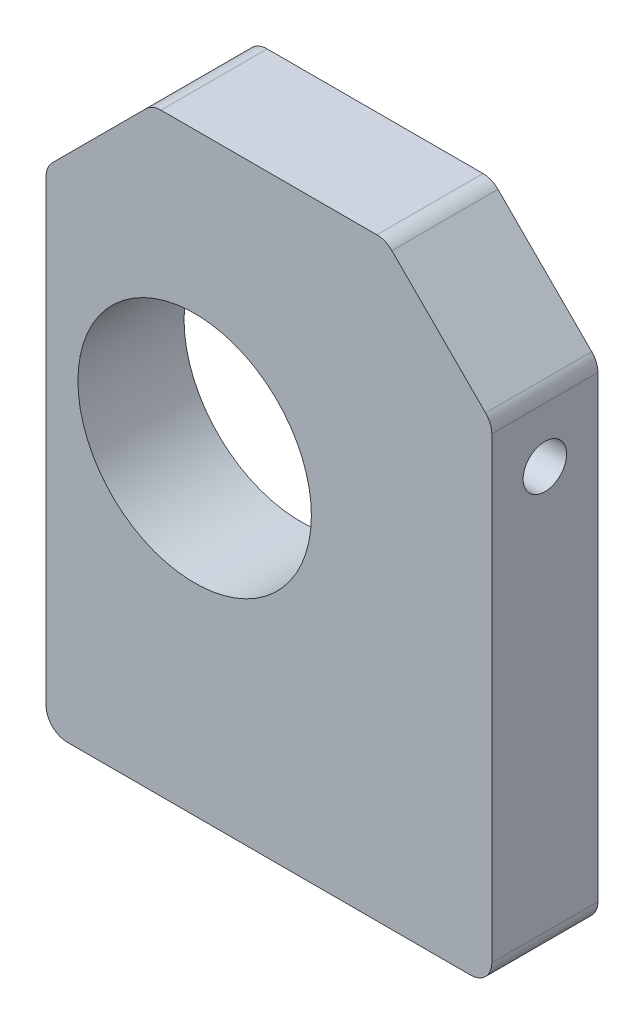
from build123d import *

# Parameters (mm, degrees)
SKETCH_1_R               = 5.5
EXTRUDE_1_DEPTH          = 5
HOLE_WIZARD_M2_5_1_D     = 2.05
HOLE_WIZARD_M2_5_1_DEPTH = 2
HOLE_WIZARD_M2_5_1_TIP   = 0.615882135
HOLE_WIZARD_M2_5_2_D     = 2.05
HOLE_WIZARD_M2_5_2_DEPTH = 2
HOLE_WIZARD_M2_5_2_TIP   = 0.615882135
FILLET_1_R               = 1


with BuildPart() as part:
    # Sketch 1 → Extrude 1 (new body)
    with BuildSketch(Plane.XY):
        Polygon((0, 0), (21, 0), (21, 23), (16, 28), (4.999719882, 28), (0, 23.000280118), align=None)
        with Locations((7, 15)):
            Circle(SKETCH_1_R, mode=Mode.SUBTRACT)
    extrude(amount=EXTRUDE_1_DEPTH)

    # Hole Wizard M2.5 _1
    with Locations(Plane(origin=(21, 0, 0), x_dir=(0, 0, -1), z_dir=(1, 0, 0))):
        with Locations((-2.5, 20)):
            Hole(HOLE_WIZARD_M2_5_1_D / 2, depth=HOLE_WIZARD_M2_5_1_DEPTH)
            with Locations((0, 0, -(HOLE_WIZARD_M2_5_1_DEPTH + HOLE_WIZARD_M2_5_1_TIP / 2))):  # 118° drill point
                Cone(0, HOLE_WIZARD_M2_5_1_D / 2, HOLE_WIZARD_M2_5_1_TIP, mode=Mode.SUBTRACT)

    # Hole Wizard M2.5 _2
    with Locations(Plane(origin=(0, 0, 0), x_dir=(-1, 0, 0), z_dir=(0, -1, 0))):
        with Locations((-13, -2.5), (-3.5, -2.5)):
            Hole(HOLE_WIZARD_M2_5_2_D / 2, depth=HOLE_WIZARD_M2_5_2_DEPTH)
            with Locations((0, 0, -(HOLE_WIZARD_M2_5_2_DEPTH + HOLE_WIZARD_M2_5_2_TIP / 2))):  # 118° drill point
                Cone(0, HOLE_WIZARD_M2_5_2_D / 2, HOLE_WIZARD_M2_5_2_TIP, mode=Mode.SUBTRACT)

    # Fillet 1
    fillet_1_edges = [part.edges().sort_by_distance(p)[0] for p in [
        (0, 23.000280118, 2.5),
        (4.999719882, 28, 2.5),
        (16, 28, 2.5),
        (21, 23, 2.5),
        (21, 0, 2.5),
        (0, 0, 2.5),
    ]]
    fillet(fillet_1_edges, radius=FILLET_1_R)


solid = part.part
